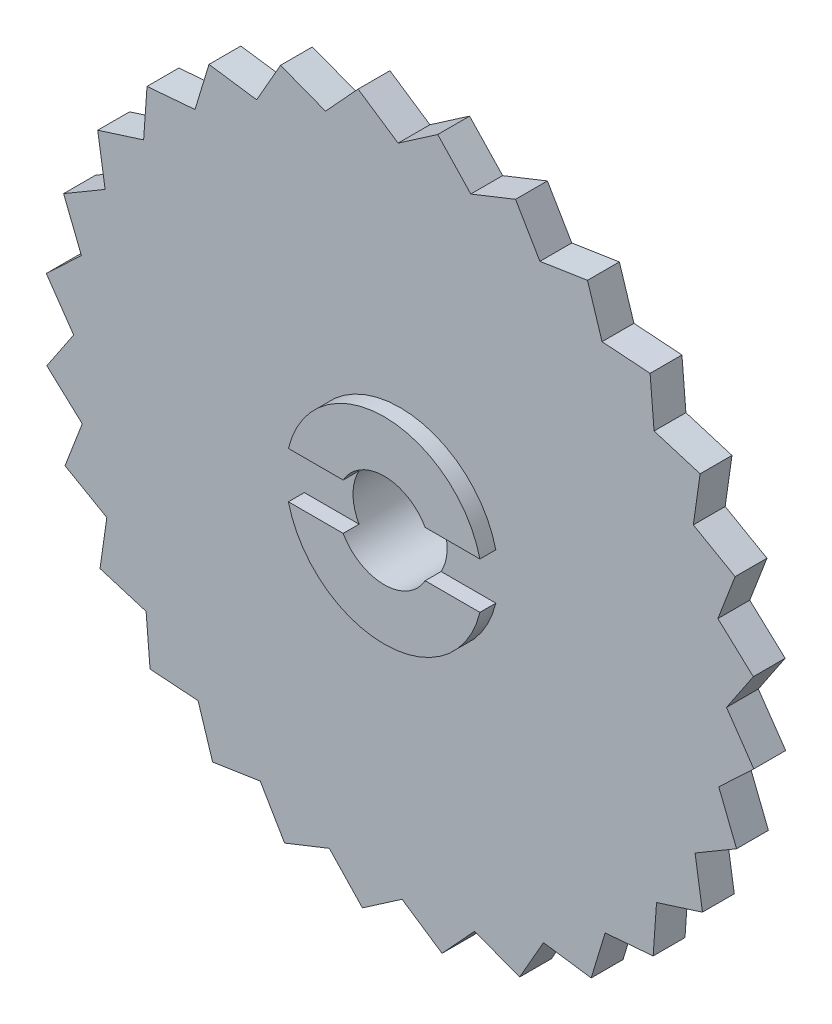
from build123d import *

# Parameters (mm, degrees)
ESQUISSE1_R                   = 22.34
EXTRUSION1_DEPTH              = 9
ENL_V_START                   = -1
ESQUISSE2_R                   = 22.34
ESQUISSE2_R_2                 = 6.185
ENL_V_MAT_EXTRU_1_DEPTH       = 1
ESQUISSE3_R                   = 2.955
ENL_V_MAT_EXTRU_2_DEPTH       = 33.850436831
ESQUISSE4_R                   = 22.34
ESQUISSE4_R_2                 = 8.5
ENL_V_MAT_EXTRU_3_DEPTH       = 6
ESQUISSE5_R                   = 8.5
ESQUISSE5_R_2                 = 6.975
ENL_V_MAT_EXTRU_4_DEPTH       = 1
ESQUISSE6_R                   = 8.5
ESQUISSE6_R_2                 = 5.97
ENL_V_MAT_EXTRU_5_DEPTH       = 3.22
ESQUISSE7_R                   = 8.5
ESQUISSE7_R_2                 = 6.96
ENL_V_MAT_EXTRU_6_DEPTH       = 1.78
ENL_V_MAT_EXTRU_7_DEPTH       = 33.590661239
ENL_V_MAT_EXTRU_14_DEPTH      = 1
ENL_V_MAT_EXTRU_15_DEPTH      = 0.5
ENL_V_MAT_EXTRU_16_DEPTH      = 33.679474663
ENL_V_MAT_EXTRU_16_DEPTH_BACK = 33.679474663


with BuildPart() as part:
    # Esquisse1 → Extrusion1 (new body)
    with BuildSketch(Plane.XY):
        Circle(ESQUISSE1_R)
    extrude(amount=EXTRUSION1_DEPTH)

    # Esquisse2 → Enl_v. mat.-Extru.1 (cut)
    with BuildSketch(Plane.XY.offset(9).offset(ENL_V_START)):
        Circle(ESQUISSE2_R)
        Circle(ESQUISSE2_R_2, mode=Mode.SUBTRACT)
    extrude(amount=ENL_V_MAT_EXTRU_1_DEPTH, mode=Mode.SUBTRACT)

    # Esquisse3 → Enl_v. mat.-Extru.2 (cut, through all)
    with BuildSketch(Plane.XY.offset(9)):
        Circle(ESQUISSE3_R)
    extrude(amount=-ENL_V_MAT_EXTRU_2_DEPTH, mode=Mode.SUBTRACT)

    # Esquisse4 → Enl_v. mat.-Extru.3 (cut)
    with BuildSketch(Plane(origin=(0, 0, 0), x_dir=(-1, 0, 0), z_dir=(0, 0, -1))):
        Circle(ESQUISSE4_R)
        Circle(ESQUISSE4_R_2, mode=Mode.SUBTRACT)
    extrude(amount=-ENL_V_MAT_EXTRU_3_DEPTH, mode=Mode.SUBTRACT)

    # Esquisse5 → Enl_v. mat.-Extru.4 (cut)
    with BuildSketch(Plane(origin=(0, 0, 0), x_dir=(-1, 0, 0), z_dir=(0, 0, -1))):
        Circle(ESQUISSE5_R)
        Circle(ESQUISSE5_R_2, mode=Mode.SUBTRACT)
    extrude(amount=-ENL_V_MAT_EXTRU_4_DEPTH, mode=Mode.SUBTRACT)

    # Esquisse6 → Enl_v. mat.-Extru.5 (cut)
    with BuildSketch(Plane(origin=(0, 0, 1), x_dir=(-1, 0, 0), z_dir=(0, 0, -1))):
        Circle(ESQUISSE6_R)
        Circle(ESQUISSE6_R_2, mode=Mode.SUBTRACT)
    extrude(amount=-ENL_V_MAT_EXTRU_5_DEPTH, mode=Mode.SUBTRACT)

    # Esquisse7 → Enl_v. mat.-Extru.6 (cut)
    with BuildSketch(Plane(origin=(0, 0, 4.22), x_dir=(-1, 0, 0), z_dir=(0, 0, -1))):
        Circle(ESQUISSE7_R)
        Circle(ESQUISSE7_R_2, mode=Mode.SUBTRACT)
    extrude(amount=-ENL_V_MAT_EXTRU_6_DEPTH, mode=Mode.SUBTRACT)

    # Esquisse9 → Enl_v. mat.-Extru.7 (cut, through all)
    with BuildSketch(Plane.XY.offset(8)):
        with BuildLine():
            Line((-18.415642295, -9.006337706), (-21.041270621, -7.50603295))
            ThreePointArc((-21.041270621, -7.50603295), (-20.068558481, -9.814711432), (-18.843472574, -11.999964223))
            Line((-18.843472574, -11.999964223), (-18.415642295, -9.006337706))
        make_face()
        with BuildLine():
            Line((-19.958022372, -4.682664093), (-22.183971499, -2.635717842))
            ThreePointArc((-22.183971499, -2.635717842), (-21.749376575, -5.102961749), (-21.041270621, -7.50603295))
            Line((-21.041270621, -7.50603295), (-19.958022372, -4.682664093))
        make_face()
        with BuildLine():
            Line((-22.33959011, -0.135328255), (-20.49962387, -0.12418215))
            Line((-20.49962387, -0.12418215), (-22.214275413, 2.366763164))
            ThreePointArc((-22.214275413, 2.366763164), (-22.312033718, 1.11747545), (-22.33959011, -0.135328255))
        make_face()
        with BuildLine():
            Line((-22.183971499, -2.635717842), (-20.49962387, -0.12418215))
            Line((-20.49962387, -0.12418215), (-22.33959011, -0.135328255))
            ThreePointArc((-22.33959011, -0.135328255), (-22.296857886, -1.387706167), (-22.183971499, -2.635717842))
        make_face()
        with BuildLine():
            Line((-15.949825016, -12.878395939), (-18.843472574, -11.999964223))
            ThreePointArc((-18.843472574, -11.999964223), (-17.381419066, -14.034310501), (-15.700784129, -15.892167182))
            Line((-15.700784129, -15.892167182), (-15.949825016, -12.878395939))
        make_face()
        with BuildLine():
            Line((-12.68421691, -16.104677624), (-15.700784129, -15.892167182))
            ThreePointArc((-15.700784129, -15.892167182), (-13.822702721, -17.55017064), (-11.770792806, -18.987470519))
            Line((-11.770792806, -18.987470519), (-12.68421691, -16.104677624))
        make_face()
        with BuildLine():
            Line((-8.782569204, -18.523403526), (-11.770792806, -18.987470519))
            ThreePointArc((-11.770792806, -18.987470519), (-9.570858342, -20.18599194), (-7.250564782, -21.130662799))
            Line((-7.250564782, -21.130662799), (-8.782569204, -18.523403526))
        make_face()
        with BuildLine():
            Line((-4.440526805, -20.013288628), (-7.250564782, -21.130662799))
            ThreePointArc((-7.250564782, -21.130662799), (-4.839091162, -21.809603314), (-2.366763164, -22.214275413))
            Line((-2.366763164, -22.214275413), (-4.440526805, -20.013288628))
        make_face()
        with BuildLine():
            Line((0.12418215, -20.49962387), (-2.366763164, -22.214275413))
            ThreePointArc((-2.366763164, -22.214275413), (0.135328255, -22.33959011), (2.635717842, -22.183971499))
            Line((2.635717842, -22.183971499), (0.12418215, -20.49962387))
        make_face()
        with BuildLine():
            Line((4.682664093, -19.958022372), (2.635717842, -22.183971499))
            ThreePointArc((2.635717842, -22.183971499), (5.102961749, -21.749376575), (7.50603295, -21.041270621))
            Line((7.50603295, -21.041270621), (4.682664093, -19.958022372))
        make_face()
        with BuildLine():
            Line((9.006337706, -18.415642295), (7.50603295, -21.041270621))
            ThreePointArc((7.50603295, -21.041270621), (9.814711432, -20.068558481), (11.999964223, -18.843472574))
            Line((11.999964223, -18.843472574), (9.006337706, -18.415642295))
        make_face()
        with BuildLine():
            Line((12.878395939, -15.949825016), (11.999964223, -18.843472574))
            ThreePointArc((11.999964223, -18.843472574), (14.034310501, -17.381419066), (15.892167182, -15.700784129))
            Line((15.892167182, -15.700784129), (12.878395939, -15.949825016))
        make_face()
        with BuildLine():
            Line((16.104677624, -12.68421691), (15.892167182, -15.700784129))
            ThreePointArc((15.892167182, -15.700784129), (17.55017064, -13.822702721), (18.987470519, -11.770792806))
            Line((18.987470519, -11.770792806), (16.104677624, -12.68421691))
        make_face()
        with BuildLine():
            Line((18.523403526, -8.782569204), (18.987470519, -11.770792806))
            ThreePointArc((18.987470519, -11.770792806), (20.18599194, -9.570858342), (21.130662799, -7.250564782))
            Line((21.130662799, -7.250564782), (18.523403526, -8.782569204))
        make_face()
        with BuildLine():
            Line((20.013288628, -4.440526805), (21.130662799, -7.250564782))
            ThreePointArc((21.130662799, -7.250564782), (21.809603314, -4.839091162), (22.214275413, -2.366763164))
            Line((22.214275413, -2.366763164), (20.013288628, -4.440526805))
        make_face()
        with BuildLine():
            Line((20.49962387, 0.12418215), (22.214275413, -2.366763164))
            ThreePointArc((22.214275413, -2.366763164), (22.308546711, -1.185050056), (22.34, 0))
            ThreePointArc((22.34, 0), (22.300958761, 1.320166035), (22.183971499, 2.635717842))
            Line((22.183971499, 2.635717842), (20.49962387, 0.12418215))
        make_face()
        with BuildLine():
            ThreePointArc((22.183971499, 2.635717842), (21.749376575, 5.102961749), (21.041270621, 7.50603295))
            Line((21.041270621, 7.50603295), (19.958022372, 4.682664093))
            Line((19.958022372, 4.682664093), (22.183971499, 2.635717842))
        make_face()
        with BuildLine():
            ThreePointArc((21.041270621, 7.50603295), (20.068558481, 9.814711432), (18.843472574, 11.999964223))
            Line((18.843472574, 11.999964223), (18.415642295, 9.006337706))
            Line((18.415642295, 9.006337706), (21.041270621, 7.50603295))
        make_face()
        with BuildLine():
            ThreePointArc((18.843472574, 11.999964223), (17.381419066, 14.034310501), (15.700784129, 15.892167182))
            Line((15.700784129, 15.892167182), (15.949825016, 12.878395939))
            Line((15.949825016, 12.878395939), (18.843472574, 11.999964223))
        make_face()
        with BuildLine():
            ThreePointArc((15.700784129, 15.892167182), (13.822702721, 17.55017064), (11.770792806, 18.987470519))
            Line((11.770792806, 18.987470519), (12.68421691, 16.104677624))
            Line((12.68421691, 16.104677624), (15.700784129, 15.892167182))
        make_face()
        with BuildLine():
            ThreePointArc((7.250564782, 21.130662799), (4.839091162, 21.809603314), (2.366763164, 22.214275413))
            Line((2.366763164, 22.214275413), (4.440526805, 20.013288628))
            Line((4.440526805, 20.013288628), (7.250564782, 21.130662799))
        make_face()
        with BuildLine():
            ThreePointArc((11.770792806, 18.987470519), (9.570858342, 20.18599194), (7.250564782, 21.130662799))
            Line((7.250564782, 21.130662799), (8.782569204, 18.523403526))
            Line((8.782569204, 18.523403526), (11.770792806, 18.987470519))
        make_face()
        with BuildLine():
            ThreePointArc((2.366763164, 22.214275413), (-0.135328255, 22.33959011), (-2.635717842, 22.183971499))
            Line((-2.635717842, 22.183971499), (-0.12418215, 20.49962387))
            Line((-0.12418215, 20.49962387), (2.366763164, 22.214275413))
        make_face()
        with BuildLine():
            ThreePointArc((-2.635717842, 22.183971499), (-5.102961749, 21.749376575), (-7.50603295, 21.041270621))
            Line((-7.50603295, 21.041270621), (-4.682664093, 19.958022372))
            Line((-4.682664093, 19.958022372), (-2.635717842, 22.183971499))
        make_face()
        with BuildLine():
            ThreePointArc((-7.50603295, 21.041270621), (-9.814711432, 20.068558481), (-11.999964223, 18.843472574))
            Line((-11.999964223, 18.843472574), (-9.006337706, 18.415642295))
            Line((-9.006337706, 18.415642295), (-7.50603295, 21.041270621))
        make_face()
        with BuildLine():
            ThreePointArc((-11.999964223, 18.843472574), (-14.034310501, 17.381419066), (-15.892167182, 15.700784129))
            Line((-15.892167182, 15.700784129), (-12.878395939, 15.949825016))
            Line((-12.878395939, 15.949825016), (-11.999964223, 18.843472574))
        make_face()
        with BuildLine():
            ThreePointArc((-18.987470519, 11.770792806), (-20.18599194, 9.570858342), (-21.130662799, 7.250564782))
            Line((-21.130662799, 7.250564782), (-18.523403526, 8.782569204))
            Line((-18.523403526, 8.782569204), (-18.987470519, 11.770792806))
        make_face()
        with BuildLine():
            ThreePointArc((-15.892167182, 15.700784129), (-17.55017064, 13.822702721), (-18.987470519, 11.770792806))
            Line((-18.987470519, 11.770792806), (-16.104677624, 12.68421691))
            Line((-16.104677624, 12.68421691), (-15.892167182, 15.700784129))
        make_face()
        with BuildLine():
            ThreePointArc((-21.130662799, 7.250564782), (-21.809603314, 4.839091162), (-22.214275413, 2.366763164))
            Line((-22.214275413, 2.366763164), (-20.013288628, 4.440526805))
            Line((-20.013288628, 4.440526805), (-21.130662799, 7.250564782))
        make_face()
    extrude(amount=-ENL_V_MAT_EXTRU_7_DEPTH, mode=Mode.SUBTRACT)

    # Esquisse13 → Enl_v. mat.-Extru.14 (cut)
    with BuildSketch(Plane.XY.offset(9)):
        Polygon((6.185, 0), (6.185, 1.45), (-6.185, 1.45), (-6.185, 0), (-6.185, -1.45), (6.185, -1.45), align=None)
    extrude(amount=-ENL_V_MAT_EXTRU_14_DEPTH, mode=Mode.SUBTRACT)

    # Esquisse14 → Enl_v. mat.-Extru.15 (cut)
    with BuildSketch(Plane(origin=(0, 0, 0), x_dir=(-1, 0, 0), z_dir=(0, 0, -1))):
        Polygon((6.975, 0), (6.975, 1.45), (-6.975, 1.45), (-6.975, -1.45), (6.975, -1.45), align=None)
    extrude(amount=-ENL_V_MAT_EXTRU_15_DEPTH, mode=Mode.SUBTRACT)

    # Esquisse15 → Enl_v. mat.-Extru.16 (cut, two sides: drawn at the far end of the back side and taken through both)
    with BuildSketch(Plane(origin=(0, 0, 0), x_dir=(0, 0, -1), z_dir=(1, 0, 0)).offset(-ENL_V_MAT_EXTRU_16_DEPTH_BACK)):
        with BuildLine():
            ThreePointArc((-1.11, 0), (-1.549339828, 1.060660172), (-2.61, 1.5))
            Line((-2.61, 1.5), (-2.61, 0))
            Line((-2.61, 0), (-1.11, 0))
        make_face()
        with BuildLine():
            Line((-2.61, 0), (-2.61, 1.5))
            ThreePointArc((-2.61, 1.5), (-3.670660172, 1.060660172), (-4.11, 0))
            Line((-4.11, 0), (-2.61, 0))
        make_face()
        with BuildLine():
            Line((-1.11, 0), (-2.61, 0))
            Line((-2.61, 0), (-2.61, -1.5))
            ThreePointArc((-2.61, -1.5), (-1.549339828, -1.060660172), (-1.11, 0))
        make_face()
        with BuildLine():
            Line((-2.61, -1.5), (-2.61, 0))
            Line((-2.61, 0), (-4.11, 0))
            ThreePointArc((-4.11, 0), (-3.670660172, -1.060660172), (-2.61, -1.5))
        make_face()
        with BuildLine():
            ThreePointArc((-1.11, 0), (-1.549339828, 1.060660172), (-2.61, 1.5))
            Line((-2.61, 1.5), (-2.61, 0))
            Line((-2.61, 0), (-1.11, 0))
        make_face()
        with BuildLine():
            Line((-2.61, 0), (-2.61, 1.5))
            ThreePointArc((-2.61, 1.5), (-3.670660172, 1.060660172), (-4.11, 0))
            Line((-4.11, 0), (-2.61, 0))
        make_face()
        with BuildLine():
            Line((-1.11, 0), (-2.61, 0))
            Line((-2.61, 0), (-2.61, -1.5))
            ThreePointArc((-2.61, -1.5), (-1.549339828, -1.060660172), (-1.11, 0))
        make_face()
        with BuildLine():
            Line((-2.61, -1.5), (-2.61, 0))
            Line((-2.61, 0), (-4.11, 0))
            ThreePointArc((-4.11, 0), (-3.670660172, -1.060660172), (-2.61, -1.5))
        make_face()
        with BuildLine():
            ThreePointArc((-1.11, 0), (-1.549339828, 1.060660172), (-2.61, 1.5))
            Line((-2.61, 1.5), (-2.61, 0))
            Line((-2.61, 0), (-1.11, 0))
        make_face()
        with BuildLine():
            Line((-2.61, 0), (-2.61, 1.5))
            ThreePointArc((-2.61, 1.5), (-3.670660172, 1.060660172), (-4.11, 0))
            Line((-4.11, 0), (-2.61, 0))
        make_face()
        with BuildLine():
            Line((-1.11, 0), (-2.61, 0))
            Line((-2.61, 0), (-2.61, -1.5))
            ThreePointArc((-2.61, -1.5), (-1.549339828, -1.060660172), (-1.11, 0))
        make_face()
        with BuildLine():
            Line((-2.61, -1.5), (-2.61, 0))
            Line((-2.61, 0), (-4.11, 0))
            ThreePointArc((-4.11, 0), (-3.670660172, -1.060660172), (-2.61, -1.5))
        make_face()
        with BuildLine():
            ThreePointArc((-1.11, 0), (-1.549339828, 1.060660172), (-2.61, 1.5))
            Line((-2.61, 1.5), (-2.61, 0))
            Line((-2.61, 0), (-1.11, 0))
        make_face()
        with BuildLine():
            Line((-2.61, 0), (-2.61, 1.5))
            ThreePointArc((-2.61, 1.5), (-3.670660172, 1.060660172), (-4.11, 0))
            Line((-4.11, 0), (-2.61, 0))
        make_face()
        with BuildLine():
            Line((-1.11, 0), (-2.61, 0))
            Line((-2.61, 0), (-2.61, -1.5))
            ThreePointArc((-2.61, -1.5), (-1.549339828, -1.060660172), (-1.11, 0))
        make_face()
        with BuildLine():
            Line((-2.61, -1.5), (-2.61, 0))
            Line((-2.61, 0), (-4.11, 0))
            ThreePointArc((-4.11, 0), (-3.670660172, -1.060660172), (-2.61, -1.5))
        make_face()
    extrude(amount=ENL_V_MAT_EXTRU_16_DEPTH + ENL_V_MAT_EXTRU_16_DEPTH_BACK, mode=Mode.SUBTRACT)


solid = part.part
